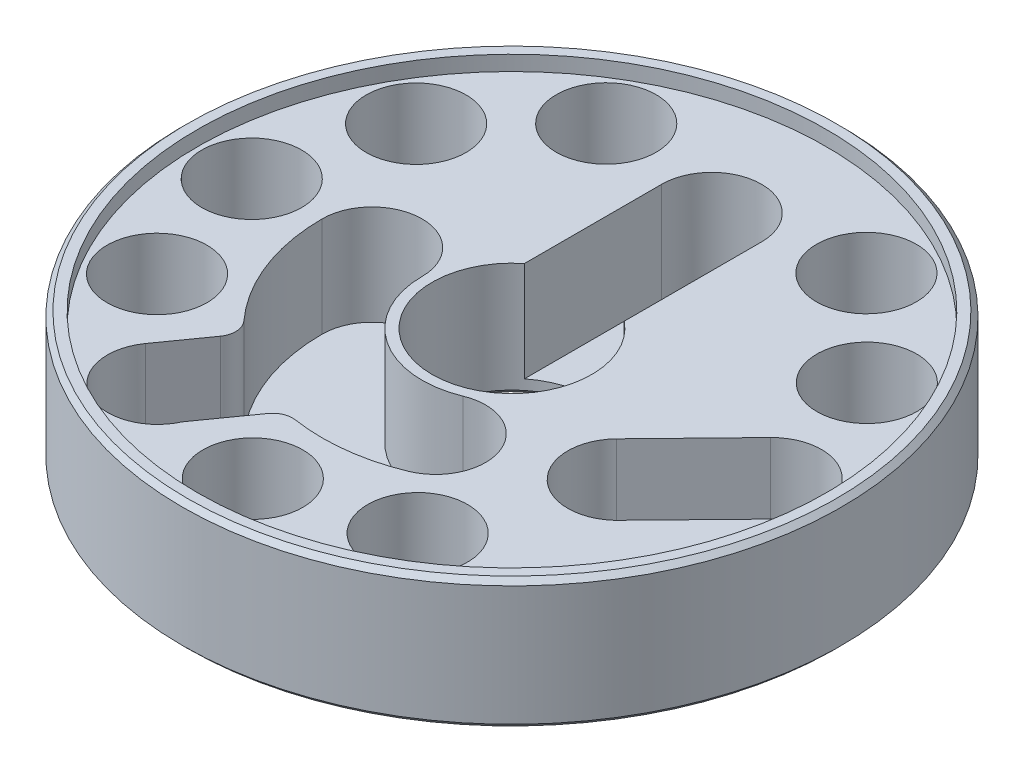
from build123d import *
from build123d.topology import SkipClean

# Parameters (mm, degrees)
SKETCH1_R           = 33
SKETCH1_R_2         = 8
BOSS_EXTRUDE1_DEPTH = 13
SKETCH2_R           = 31.5
CUT_EXTRUDE1_DEPTH  = 1.5
CHAMFER1_SIZE       = 0.5
SKETCH3_R           = 5
CUT_EXTRUDE2_DEPTH  = 49.065060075
SKETCH4_R           = 5
CUT_EXTRUDE3_DEPTH  = 49.065060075
SKETCH5_W           = 10
SKETCH5_H           = 13.755002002
CUT_EXTRUDE4_DEPTH  = 10
SKETCH6_R           = 5
CUT_EXTRUDE5_DEPTH  = 49.065060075
CUT_EXTRUDE6_DEPTH  = 10
SKETCH7_R           = 5
CUT_EXTRUDE7_DEPTH  = 49.065060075


with BuildPart() as part:
    # Sketch1 → Boss-Extrude1 (new body)
    with BuildSketch(Plane(origin=(0, 0, 0), x_dir=(1, 0, 0), z_dir=(0, 1, 0))):
        with Locations(Location((0, 0, 0), (0, 0, 270))):
            Circle(SKETCH1_R)
        with Locations(Location((0, 0, 0), (0, 0, 270))):
            Circle(SKETCH1_R_2, mode=Mode.SUBTRACT)
    extrude(amount=-BOSS_EXTRUDE1_DEPTH)

    # Sketch2 → Cut-Extrude1 (cut)
    with BuildSketch(Plane(origin=(0, 0, 0), x_dir=(1, 0, 0), z_dir=(0, 1, 0))):
        with Locations(Location((0, 0, 0), (0, 0, 270))):
            Circle(SKETCH2_R)
    extrude(amount=-CUT_EXTRUDE1_DEPTH, mode=Mode.SUBTRACT)

    # Chamfer1
    chamfer1_edges = [part.edges().sort_by_distance(p)[0] for p in [
        (0, 0, -33),
        (0, -13, -33),
        (0, -13, -8),
    ]]
    chamfer(chamfer1_edges, length=CHAMFER1_SIZE)

    # Sketch3 → Cut-Extrude2 (cut, through all)
    with BuildSketch(Plane(origin=(0, -1.5, 0), x_dir=(1, 0, 0), z_dir=(0, 1, 0))):
        with Locations(Location((0, 20, 0), (0, 0, 270))):
            Circle(SKETCH3_R)
        with Locations(Location((18.410097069, -7.81462257, 0), (0, 0, 270))):
            Circle(SKETCH3_R)
    extrude(amount=-CUT_EXTRUDE2_DEPTH, mode=Mode.SUBTRACT)

    # Sketch4 → Cut-Extrude3 (cut, through all)
    with BuildSketch(Plane(origin=(0, -1.5, 0), x_dir=(1, 0, 0), z_dir=(0, 1, 0))):
        with Locations(Location((26, 0, 0), (0, 0, 270))):
            Circle(SKETCH4_R)
    extrude(amount=-CUT_EXTRUDE3_DEPTH, mode=Mode.SUBTRACT)

    # Sketch5 → Cut-Extrude4 (cut)
    with BuildSketch(Plane(origin=(0, -1.5, 0), x_dir=(1, 0, 0), z_dir=(0, 1, 0))):
        with Locations((0, 13.122498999)):
            Rectangle(SKETCH5_W, SKETCH5_H)
        Polygon((14.822519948, -4.331909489), (22.41051804, 3.484562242), (29.58948196, -3.484562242), (21.826727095, -11.465189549), align=None)
    extrude(amount=-CUT_EXTRUDE4_DEPTH, mode=Mode.SUBTRACT)

    # Sketch6 → Cut-Extrude5 (cut, through all)
    with BuildSketch(Plane(origin=(0, -1.5, 0), x_dir=(1, 0, 0), z_dir=(0, 1, 0))):
        with Locations(Location((-13.047825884, 22.488980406, 0), (0, 0, 270))):
            Circle(SKETCH6_R)
        with Locations(Location((-22.544238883, 12.952115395, 0), (0, 0, 270))):
            Circle(SKETCH6_R)
        with Locations(Location((-25.999941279, -0.055258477, 0), (0, 0, 270))):
            Circle(SKETCH6_R)
        with Locations(Location((-22.488980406, -13.047825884, 0), (0, 0, 270))):
            Circle(SKETCH6_R)
        with Locations(Location((0.055258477, -25.999941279, 0), (0, 0, 270))):
            Circle(SKETCH6_R)
        with Locations(Location((13.047825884, -22.488980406, 0), (0, 0, 270))):
            Circle(SKETCH6_R)
        with Locations(Location((22.488980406, 13.047825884, 0), (0, 0, 270))):
            Circle(SKETCH6_R)
        with Locations(Location((12.952115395, 22.544238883, 0), (0, 0, 270))):
            Circle(SKETCH6_R)
    extrude(amount=-CUT_EXTRUDE5_DEPTH, mode=Mode.SUBTRACT)

    # Sketch6_3 → Cut-Extrude6 (cut)
    with BuildSketch(Plane(origin=(0, -1.5, 0), x_dir=(1, 0, 0), z_dir=(0, 1, 0))):
        with BuildLine():
            ThreePointArc((-13.919069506, -15.272835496), (-13.552962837, -13.995175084), (-14.068510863, -12.770160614))
            ThreePointArc((-14.068510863, -12.770160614), (-17.724301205, -6.844643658), (-19, 0))
            ThreePointArc((-19, 0), (-14, 5), (-9, 0))
            ThreePointArc((-9, 0), (-5.01260793, -7.474875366), (3.416391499, -8.326359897))
            ThreePointArc((3.416391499, -8.326359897), (9.940142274, -11.054120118), (7.212382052, -17.577870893))
            ThreePointArc((7.212382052, -17.577870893), (2.237645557, -18.867775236), (-2.900803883, -18.777255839))
            ThreePointArc((-2.900803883, -18.777255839), (-3.984755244, -18.911588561), (-4.836488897, -19.595361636))
            Line((-4.836488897, -19.595361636), (-8.397273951, -24.606620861))
            ThreePointArc((-8.397273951, -24.606620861), (-15.442906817, -26.879669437), (-17.027958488, -19.648120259))
            Line((-17.027958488, -19.648120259), (-13.919069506, -15.272835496))
        make_face()
    extrude(amount=-CUT_EXTRUDE6_DEPTH, mode=Mode.SUBTRACT)

    # Sketch7 → Cut-Extrude7 (cut, through all)
    with SkipClean():  # the faces are left unmerged after this step: merging them gives an invalid solid
        with BuildSketch(Plane(origin=(0, -11.5, 0), x_dir=(1, 0, 0), z_dir=(0, 1, 0))):
            with Locations(Location((-12.952115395, -22.544238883, 0), (0, 0, 270))):
                Circle(SKETCH7_R)
        extrude(amount=-CUT_EXTRUDE7_DEPTH, mode=Mode.SUBTRACT)


solid = part.part
